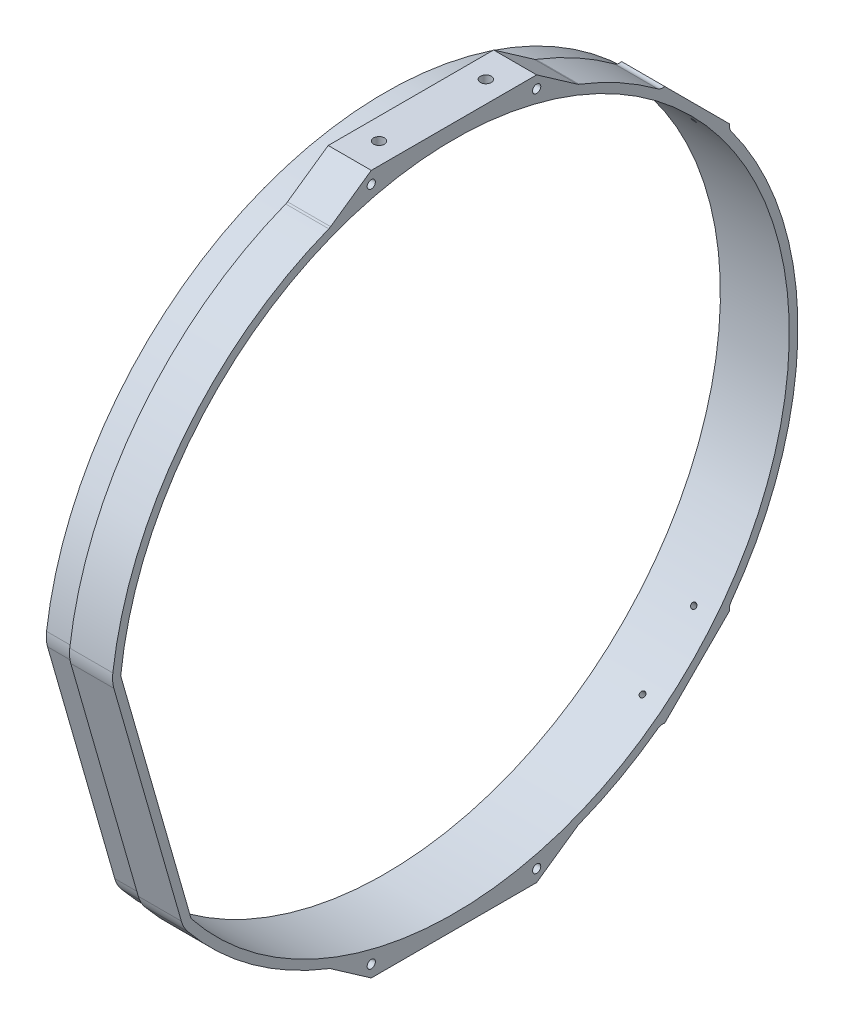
from build123d import *

# Parameters (mm, degrees)
EXTRUDE1_DEPTH = 50
SKETCH50_R     = 3.175
EXTRUDE4_DEPTH = 30
SKETCH51_R     = 3.175
EXTRUDE5_DEPTH = 30
EXTRUDE6_START = 30
EXTRUDE6_DEPTH = 30
SKETCH53_R     = 4.763
EXTRUDE7_DEPTH = 576.044772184
SKETCH54_R     = 6.35
EXTRUDE8_DEPTH = 20
EXTRUDE9_START = -20
SKETCH55_R     = 6.35
EXTRUDE9_DEPTH = 20
FILLET1_R      = 10
FILLET2_R      = 40


with BuildPart() as part:
    # Sketch1 → Extrude1 (new body)
    with BuildSketch(Plane(origin=(0, 0, 0), x_dir=(0, -1, 0), z_dir=(-1, 0, 0))):
        with BuildLine():
            Line((-320.064813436, -244.630662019), (-244.630662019, -320.064813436))
            ThreePointArc((-244.630662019, -320.064813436), (-240.363974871, -320.016965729), (-236.465757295, -321.752133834))
            ThreePointArc((-236.465757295, -321.752133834), (0, -399.3), (236.465757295, -321.752133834))
            ThreePointArc((236.465757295, -321.752133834), (240.363974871, -320.016965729), (244.630662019, -320.064813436))
            Line((244.630662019, -320.064813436), (320.064813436, -244.630662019))
            ThreePointArc((320.064813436, -244.630662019), (320.016965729, -240.363974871), (321.752133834, -236.465757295))
            ThreePointArc((321.752133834, -236.465757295), (350.094192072, -192.027463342), (372.336333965, -144.243351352))
            Line((372.336333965, -144.243351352), (406, -96))
            Line((406, -96), (406, 96))
            Line((406, 96), (372.336333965, 144.243351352))
            ThreePointArc((372.336333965, 144.243351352), (320.792235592, 237.766338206), (246.304756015, 314.284038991))
            Line((246.304756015, 314.284038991), (-42.33311271, 397.049616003))
            ThreePointArc((-42.33311271, 397.049616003), (-242.828003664, 316.977997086), (-372.336333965, 144.243351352))
            Line((-372.336333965, 144.243351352), (-406, 96))
            Line((-406, 96), (-406, -96))
            Line((-406, -96), (-372.336333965, -144.243351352))
            ThreePointArc((-372.336333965, -144.243351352), (-350.094192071, -192.027463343), (-321.752133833, -236.465757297))
            ThreePointArc((-321.752133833, -236.465757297), (-320.016965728, -240.363974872), (-320.064813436, -244.630662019))
        make_face()
        with BuildLine():
            Line((241.660051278, 305.212892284), (-43.20115509, 386.895528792))
            ThreePointArc((-43.20115509, 386.895528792), (-107.30562262, -374.219178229), (241.660051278, 305.212892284))
        make_face(mode=Mode.SUBTRACT)
    extrude(amount=-EXTRUDE1_DEPTH)

    # Sketch50 → Extrude4 (cut)
    with BuildSketch(Plane(origin=(0, 282.347737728, -282.347737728), x_dir=(1, 0, 0), z_dir=(0, 0.7071067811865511, -0.7071067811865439))):
        with Locations(Location((25, 42, 0), (0, 0, 270))):
            Circle(SKETCH50_R)
        with Locations(Location((25, -42, 0), (0, 0, 270))):
            Circle(SKETCH50_R)
    extrude(amount=-EXTRUDE4_DEPTH, mode=Mode.SUBTRACT)

    # Sketch51 → Extrude5 (cut)
    with BuildSketch(Plane(origin=(0, -282.347737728, -282.347737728), x_dir=(1, 0, 0), z_dir=(0, -0.7071067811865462, -0.7071067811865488))):
        with Locations(Location((25, 42, 0), (0, 0, 270))):
            Circle(SKETCH51_R)
        with Locations(Location((25, -42, 0), (0, 0, 270))):
            Circle(SKETCH51_R)
    extrude(amount=-EXTRUDE5_DEPTH, mode=Mode.SUBTRACT)

    # Sketch52 → Extrude6 (add)
    with BuildSketch(Plane.ZY.offset(EXTRUDE6_START)):
        with BuildLine():
            Line((311.561948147, -244.913949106), (394.004136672, 42.596129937))
            ThreePointArc((394.004136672, 42.596129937), (-380.9480101, 109.23508411), (311.561948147, -244.913949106))
        make_face()
        with BuildLine():
            Line((305.212892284, -241.660051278), (386.895528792, 43.20115509))
            ThreePointArc((386.895528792, 43.20115509), (-374.219178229, 107.30562262), (305.212892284, -241.660051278))
        make_face(mode=Mode.SUBTRACT)
    extrude(amount=-EXTRUDE6_DEPTH)

    # Sketch53 → Extrude7 (cut, through all)
    with BuildSketch(Plane(origin=(50, 0, 0), x_dir=(0, 0, -1), z_dir=(1, 0, 0))):
        with Locations((-96, 392)):
            Circle(SKETCH53_R)
        with Locations((96, 392)):
            Circle(SKETCH53_R)
        with Locations((-96, -392)):
            Circle(SKETCH53_R)
        with Locations((96, -392)):
            Circle(SKETCH53_R)
    extrude(amount=-EXTRUDE7_DEPTH, mode=Mode.SUBTRACT)

    # Sketch54 → Extrude8 (cut)
    with BuildSketch(Plane(origin=(0, 406, 0), x_dir=(1, 0, 0), z_dir=(0, 1, 0))):
        with Locations(Location((25, 62, 0), (0, 0, 270))):
            Circle(SKETCH54_R)
        with Locations(Location((25, -62, 0), (0, 0, 270))):
            Circle(SKETCH54_R)
    extrude(amount=-EXTRUDE8_DEPTH, mode=Mode.SUBTRACT)

    # Sketch55 → Extrude9 (cut)
    with BuildSketch(Plane.XZ.offset(406).offset(EXTRUDE9_START)):
        with Locations(Location((25, 62, 0), (0, 0, 90))):
            Circle(SKETCH55_R)
        with Locations(Location((25, -62, 0), (0, 0, 90))):
            Circle(SKETCH55_R)
    extrude(amount=EXTRUDE9_DEPTH, mode=Mode.SUBTRACT)

    # Fillet1
    fillet1_edges = [part.edges().sort_by_distance(p)[0] for p in [
        (25, 372.336333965, -144.243351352),
        (25, 372.336333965, 144.243351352),
        (25, -372.336333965, 144.243351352),
        (25, -372.336333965, -144.243351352),
    ]]
    fillet(fillet1_edges, radius=FILLET1_R)

    # Fillet2
    fillet2_edges = [part.edges().sort_by_distance(p)[0] for p in [
        (25, 42.33311271, 397.049616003),
        (25, -246.304756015, 314.284038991),
        (-15, 42.596129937, 394.004136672),
        (-15, -244.913949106, 311.561948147),
    ]]
    fillet(fillet2_edges, radius=FILLET2_R)


solid = part.part
